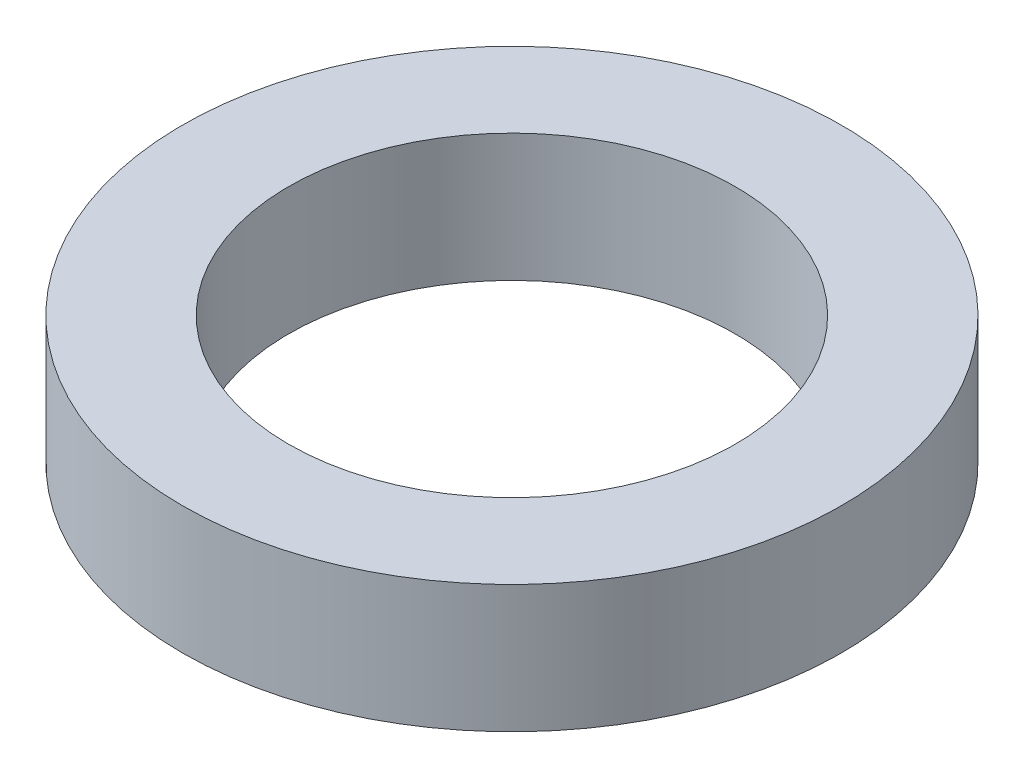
ISO-10303-21;
HEADER;
FILE_DESCRIPTION(('STEP AP214'),'2;1');
FILE_NAME('part.step','',(''),(''),'','','');
FILE_SCHEMA(('AUTOMOTIVE_DESIGN { 1 0 10303 214 1 1 1 1 }'));
ENDSEC;
DATA;
#1=APPLICATION_CONTEXT('core data for automotive mechanical design processes');
#2=APPLICATION_PROTOCOL_DEFINITION('international standard','automotive_design',2000,#1);
#3=PRODUCT_CONTEXT('',#1,'mechanical');
#4=PRODUCT('Part','Part','',(#3));
#5=PRODUCT_RELATED_PRODUCT_CATEGORY('part','',(#4));
#6=PRODUCT_DEFINITION_FORMATION('','',#4);
#7=PRODUCT_DEFINITION_CONTEXT('part definition',#1,'design');
#8=PRODUCT_DEFINITION('design','',#6,#7);
#9=PRODUCT_DEFINITION_SHAPE('','',#8);
#10=(LENGTH_UNIT() NAMED_UNIT(*) SI_UNIT(.MILLI.,.METRE.));
#11=(NAMED_UNIT(*) PLANE_ANGLE_UNIT() SI_UNIT($,.RADIAN.));
#12=(NAMED_UNIT(*) SI_UNIT($,.STERADIAN.) SOLID_ANGLE_UNIT());
#13=UNCERTAINTY_MEASURE_WITH_UNIT(LENGTH_MEASURE(1.E-05),#10,'distance_accuracy_value','');
#14=(GEOMETRIC_REPRESENTATION_CONTEXT(3) GLOBAL_UNCERTAINTY_ASSIGNED_CONTEXT((#13)) GLOBAL_UNIT_ASSIGNED_CONTEXT((#10,
#11,#12)) REPRESENTATION_CONTEXT('',''));
#15=CARTESIAN_POINT('',(0.,0.,0.));
#16=DIRECTION('',(0.,0.,1.));
#17=DIRECTION('',(1.,0.,0.));
#18=AXIS2_PLACEMENT_3D('',#15,#16,#17);
#19=CARTESIAN_POINT('',(0.,12.,0.));
#20=DIRECTION('',(0.,1.,0.));
#21=DIRECTION('',(0.,0.,1.));
#22=AXIS2_PLACEMENT_3D('',#19,#20,#21);
#23=PLANE('',#22);
#24=CARTESIAN_POINT('',(0.,12.,0.));
#25=DIRECTION('',(0.,1.,0.));
#26=DIRECTION('',(0.,0.,1.));
#27=AXIS2_PLACEMENT_3D('',#24,#25,#26);
#28=CIRCLE('',#27,31.);
#29=CARTESIAN_POINT('',(0.,12.,31.));
#30=VERTEX_POINT('',#29);
#31=EDGE_CURVE('E10',#30,#30,#28,.T.);
#32=ORIENTED_EDGE('',*,*,#31,.T.);
#33=EDGE_LOOP('',(#32));
#34=FACE_BOUND('',#33,.T.);
#35=CARTESIAN_POINT('',(0.,12.,0.));
#36=DIRECTION('',(0.,1.,0.));
#37=DIRECTION('',(0.,0.,1.));
#38=AXIS2_PLACEMENT_3D('',#35,#36,#37);
#39=CIRCLE('',#38,21.);
#40=CARTESIAN_POINT('',(0.,12.,21.));
#41=VERTEX_POINT('',#40);
#42=EDGE_CURVE('E54',#41,#41,#39,.T.);
#43=ORIENTED_EDGE('',*,*,#42,.F.);
#44=EDGE_LOOP('',(#43));
#45=FACE_BOUND('',#44,.T.);
#46=ADVANCED_FACE('F41',(#34,#45),#23,.T.);
#47=CARTESIAN_POINT('',(0.,0.,0.));
#48=DIRECTION('',(0.,1.,0.));
#49=DIRECTION('',(0.,0.,1.));
#50=AXIS2_PLACEMENT_3D('',#47,#48,#49);
#51=PLANE('',#50);
#52=CARTESIAN_POINT('',(0.,0.,0.));
#53=DIRECTION('',(0.,1.,0.));
#54=DIRECTION('',(0.,0.,1.));
#55=AXIS2_PLACEMENT_3D('',#52,#53,#54);
#56=CIRCLE('',#55,31.);
#57=CARTESIAN_POINT('',(0.,0.,31.));
#58=VERTEX_POINT('',#57);
#59=EDGE_CURVE('E45',#58,#58,#56,.T.);
#60=ORIENTED_EDGE('',*,*,#59,.F.);
#61=EDGE_LOOP('',(#60));
#62=FACE_BOUND('',#61,.T.);
#63=CARTESIAN_POINT('',(0.,0.,0.));
#64=DIRECTION('',(0.,1.,0.));
#65=DIRECTION('',(0.,0.,1.));
#66=AXIS2_PLACEMENT_3D('',#63,#64,#65);
#67=CIRCLE('',#66,21.);
#68=CARTESIAN_POINT('',(0.,0.,21.));
#69=VERTEX_POINT('',#68);
#70=EDGE_CURVE('E56',#69,#69,#67,.T.);
#71=ORIENTED_EDGE('',*,*,#70,.T.);
#72=EDGE_LOOP('',(#71));
#73=FACE_BOUND('',#72,.T.);
#74=ADVANCED_FACE('F68',(#62,#73),#51,.F.);
#75=CARTESIAN_POINT('',(0.,12.,0.));
#76=DIRECTION('',(0.,-1.,0.));
#77=DIRECTION('',(0.,0.,-1.));
#78=AXIS2_PLACEMENT_3D('',#75,#76,#77);
#79=CYLINDRICAL_SURFACE('',#78,31.);
#80=ORIENTED_EDGE('',*,*,#31,.F.);
#81=EDGE_LOOP('',(#80));
#82=FACE_BOUND('',#81,.T.);
#83=ORIENTED_EDGE('',*,*,#59,.T.);
#84=EDGE_LOOP('',(#83));
#85=FACE_BOUND('',#84,.T.);
#86=ADVANCED_FACE('F43',(#82,#85),#79,.T.);
#87=CARTESIAN_POINT('',(0.,12.,0.));
#88=DIRECTION('',(0.,-1.,0.));
#89=DIRECTION('',(0.,0.,-1.));
#90=AXIS2_PLACEMENT_3D('',#87,#88,#89);
#91=CYLINDRICAL_SURFACE('',#90,21.);
#92=ORIENTED_EDGE('',*,*,#42,.T.);
#93=EDGE_LOOP('',(#92));
#94=FACE_BOUND('',#93,.T.);
#95=ORIENTED_EDGE('',*,*,#70,.F.);
#96=EDGE_LOOP('',(#95));
#97=FACE_BOUND('',#96,.T.);
#98=ADVANCED_FACE('F64',(#94,#97),#91,.F.);
#99=CLOSED_SHELL('',(#46,#74,#86,#98));
#100=MANIFOLD_SOLID_BREP('B2',#99);
#101=ADVANCED_BREP_SHAPE_REPRESENTATION('',(#18,#100),#14);
#102=SHAPE_DEFINITION_REPRESENTATION(#9,#101);
ENDSEC;
END-ISO-10303-21;
